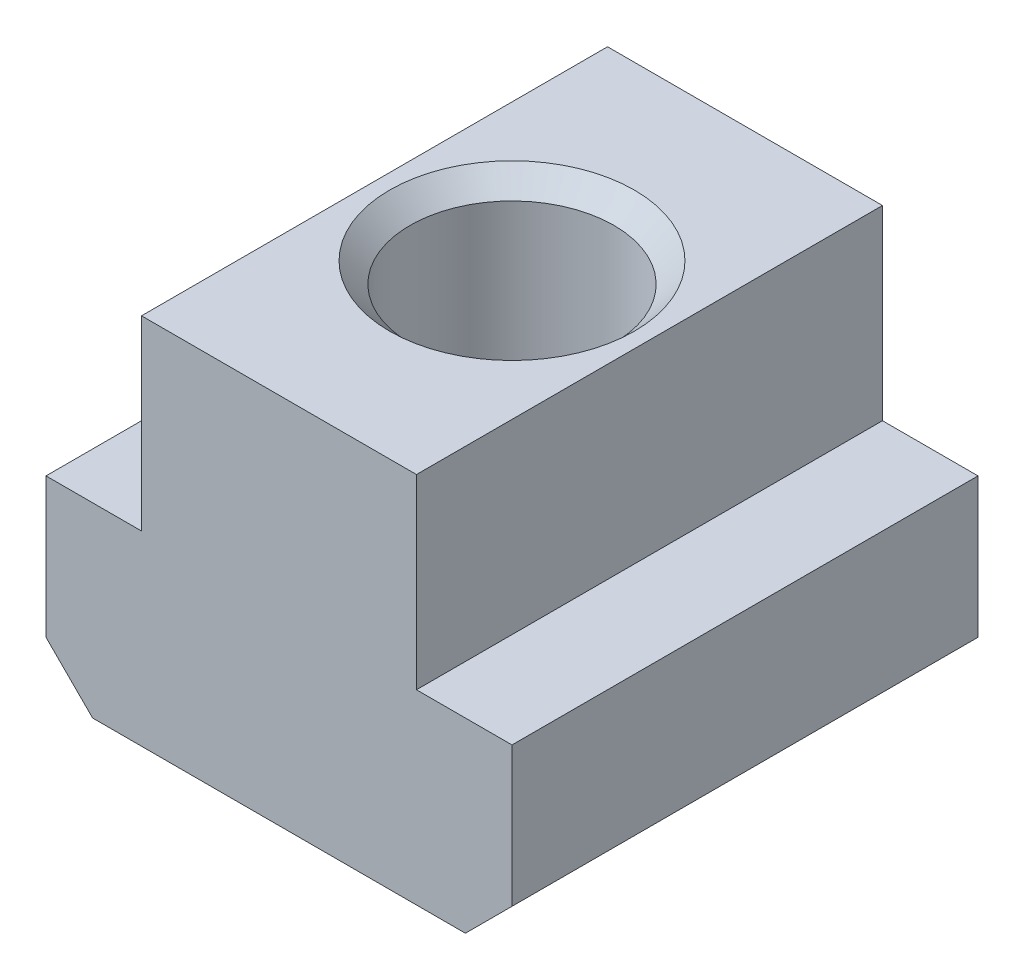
from build123d import *

# Parameters (mm, degrees)
BOSS_EXTRU_1_DEPTH           = 20
TROU_TARAUD_M201_D           = 17.5
TROU_TARAUD_M201_CSINK_D     = 21
TROU_TARAUD_M201_CSINK_ANGLE = 90
CHANFREIN1_SIZE              = 4


with BuildPart() as part:
    # Esquisse1 → Boss.-Extru.1 (new, symmetric)
    with BuildSketch(Plane.XY):
        Polygon((11.8, 0), (20, 0), (20, -16), (-20, -16), (-20, 0), (-11.8, 0), (-11.8, 16), (11.8, 16), align=None)
    extrude(amount=BOSS_EXTRU_1_DEPTH, both=True)

    # Trou taraud_ M201 (through all)
    with Locations(Plane(origin=(0, 16, 0), x_dir=(1, 0, 0), z_dir=(0, 1, 0))):
        with Locations((0, 0)):
            CounterSinkHole(TROU_TARAUD_M201_D / 2, TROU_TARAUD_M201_CSINK_D / 2, counter_sink_angle=TROU_TARAUD_M201_CSINK_ANGLE)

    # Chanfrein1
    chanfrein1_edges = [part.edges().sort_by_distance(p)[0] for p in [
        (20, -16, 0),
        (-20, -16, 0),
    ]]
    chamfer(chanfrein1_edges, length=CHANFREIN1_SIZE)


solid = part.part
